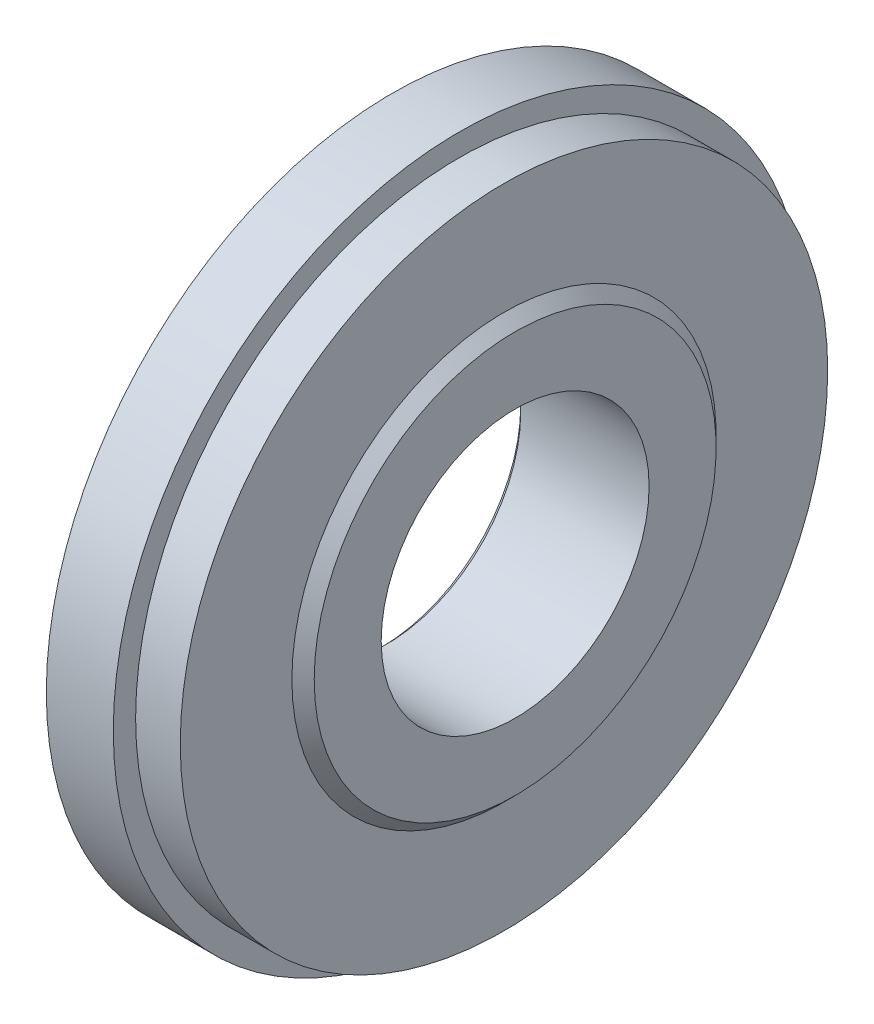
from build123d import *

# Parameters (mm, degrees)
CHANFREIN1_SIZE = 0.5


with BuildPart() as part:
    # Esquisse1 → Base-R_volution (revolve)
    with BuildSketch(Plane.XY, mode=Mode.PRIVATE) as base_r_volution_sk:
        with BuildLine():
            Line((0, 12), (0, 16))
            Line((0, 16), (5, 16))
            ThreePointArc((5, 16), (6.414213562, 16.585786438), (7, 18))
            Line((7, 18), (7, 26))
            ThreePointArc((7, 26), (6.414213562, 27.414213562), (5, 28))
            Line((5, 28), (1, 28))
            Line((1, 28), (1, 31))
            Line((1, 31), (7, 31))
            Line((7, 31), (7, 29))
            Line((7, 29), (11, 29))
            Line((11, 29), (11, 19))
            Line((11, 19), (12, 18))
            Line((12, 18), (12, 12))
            Line((12, 12), (0, 12))
        make_face()
    revolve(base_r_volution_sk.sketch.rotate(Axis((-8, 0, 0), (1, 0, 0)), 90), axis=Axis((-8, 0, 0), (1, 0, 0)))

    # Chanfrein1
    chanfrein1_edges = [part.edges().sort_by_distance(p)[0] for p in [
        (0, 0, -12),
        (0, 0, -16),
    ]]
    chamfer(chanfrein1_edges, length=CHANFREIN1_SIZE)


solid = part.part
